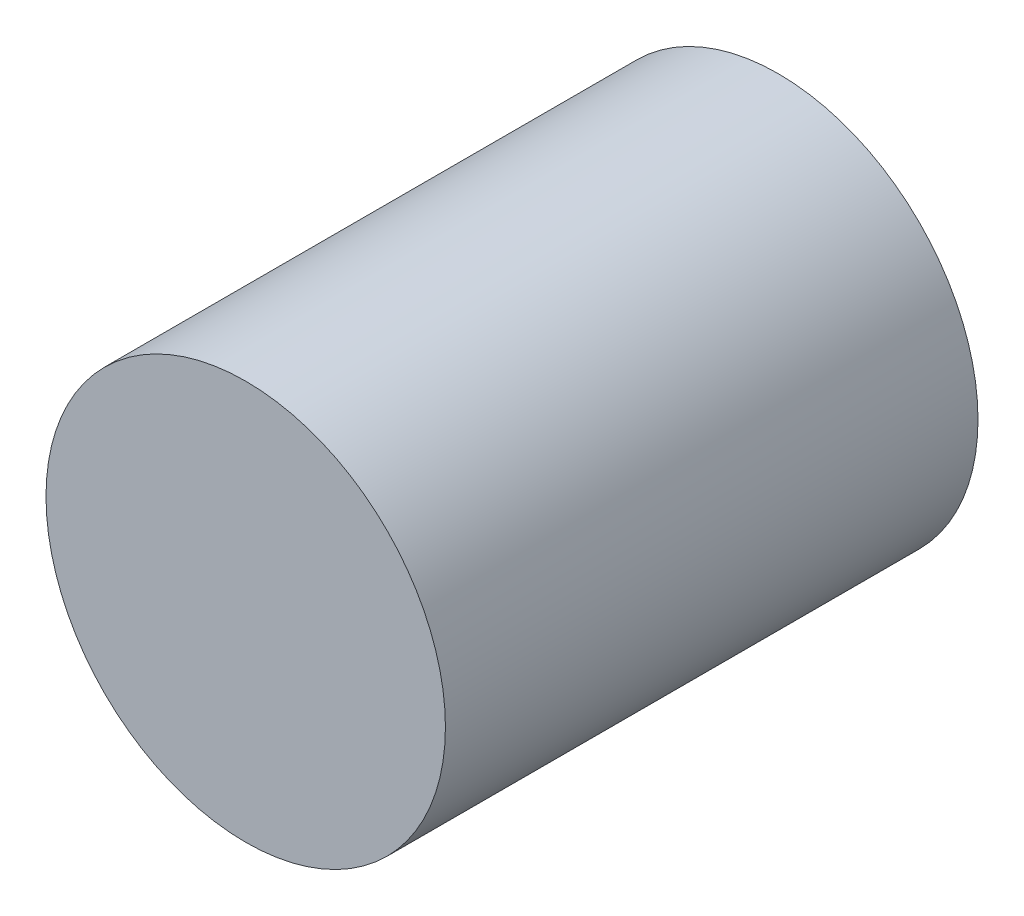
ISO-10303-21;
HEADER;
FILE_DESCRIPTION(('STEP AP214'),'2;1');
FILE_NAME('part.step','',(''),(''),'','','');
FILE_SCHEMA(('AUTOMOTIVE_DESIGN { 1 0 10303 214 1 1 1 1 }'));
ENDSEC;
DATA;
#1=APPLICATION_CONTEXT('core data for automotive mechanical design processes');
#2=APPLICATION_PROTOCOL_DEFINITION('international standard','automotive_design',2000,#1);
#3=PRODUCT_CONTEXT('',#1,'mechanical');
#4=PRODUCT('Part','Part','',(#3));
#5=PRODUCT_RELATED_PRODUCT_CATEGORY('part','',(#4));
#6=PRODUCT_DEFINITION_FORMATION('','',#4);
#7=PRODUCT_DEFINITION_CONTEXT('part definition',#1,'design');
#8=PRODUCT_DEFINITION('design','',#6,#7);
#9=PRODUCT_DEFINITION_SHAPE('','',#8);
#10=(LENGTH_UNIT() NAMED_UNIT(*) SI_UNIT(.MILLI.,.METRE.));
#11=(NAMED_UNIT(*) PLANE_ANGLE_UNIT() SI_UNIT($,.RADIAN.));
#12=(NAMED_UNIT(*) SI_UNIT($,.STERADIAN.) SOLID_ANGLE_UNIT());
#13=UNCERTAINTY_MEASURE_WITH_UNIT(LENGTH_MEASURE(1.E-05),#10,'distance_accuracy_value','');
#14=(GEOMETRIC_REPRESENTATION_CONTEXT(3) GLOBAL_UNCERTAINTY_ASSIGNED_CONTEXT((#13)) GLOBAL_UNIT_ASSIGNED_CONTEXT((#10,
#11,#12)) REPRESENTATION_CONTEXT('',''));
#15=CARTESIAN_POINT('',(0.,0.,0.));
#16=DIRECTION('',(0.,0.,1.));
#17=DIRECTION('',(1.,0.,0.));
#18=AXIS2_PLACEMENT_3D('',#15,#16,#17);
#19=CARTESIAN_POINT('',(0.,0.,51.4175));
#20=DIRECTION('',(0.,0.,-1.));
#21=DIRECTION('',(-1.,0.,0.));
#22=AXIS2_PLACEMENT_3D('',#19,#20,#21);
#23=CYLINDRICAL_SURFACE('',#22,9.825);
#24=CARTESIAN_POINT('',(0.,0.,51.4175));
#25=DIRECTION('',(0.,0.,1.));
#26=DIRECTION('',(1.,0.,0.));
#27=AXIS2_PLACEMENT_3D('',#24,#25,#26);
#28=CIRCLE('',#27,9.825);
#29=CARTESIAN_POINT('',(9.825,0.,51.4175));
#30=VERTEX_POINT('',#29);
#31=EDGE_CURVE('E10',#30,#30,#28,.T.);
#32=ORIENTED_EDGE('',*,*,#31,.F.);
#33=EDGE_LOOP('',(#32));
#34=FACE_BOUND('',#33,.T.);
#35=CARTESIAN_POINT('',(0.,0.,25.2175));
#36=DIRECTION('',(0.,0.,1.));
#37=DIRECTION('',(1.,0.,0.));
#38=AXIS2_PLACEMENT_3D('',#35,#36,#37);
#39=CIRCLE('',#38,9.825);
#40=CARTESIAN_POINT('',(9.825,0.,25.2175));
#41=VERTEX_POINT('',#40);
#42=EDGE_CURVE('E38',#41,#41,#39,.T.);
#43=ORIENTED_EDGE('',*,*,#42,.T.);
#44=EDGE_LOOP('',(#43));
#45=FACE_BOUND('',#44,.T.);
#46=ADVANCED_FACE('F32',(#34,#45),#23,.T.);
#47=CARTESIAN_POINT('',(0.,0.,51.4175));
#48=DIRECTION('',(0.,0.,1.));
#49=DIRECTION('',(1.,0.,0.));
#50=AXIS2_PLACEMENT_3D('',#47,#48,#49);
#51=PLANE('',#50);
#52=ORIENTED_EDGE('',*,*,#31,.T.);
#53=EDGE_LOOP('',(#52));
#54=FACE_BOUND('',#53,.T.);
#55=ADVANCED_FACE('F47',(#54),#51,.T.);
#56=CARTESIAN_POINT('',(0.,0.,25.2175));
#57=DIRECTION('',(0.,0.,1.));
#58=DIRECTION('',(1.,0.,0.));
#59=AXIS2_PLACEMENT_3D('',#56,#57,#58);
#60=PLANE('',#59);
#61=ORIENTED_EDGE('',*,*,#42,.F.);
#62=EDGE_LOOP('',(#61));
#63=FACE_BOUND('',#62,.T.);
#64=ADVANCED_FACE('F45',(#63),#60,.F.);
#65=CLOSED_SHELL('',(#46,#55,#64));
#66=MANIFOLD_SOLID_BREP('B2',#65);
#67=ADVANCED_BREP_SHAPE_REPRESENTATION('',(#18,#66),#14);
#68=SHAPE_DEFINITION_REPRESENTATION(#9,#67);
ENDSEC;
END-ISO-10303-21;
